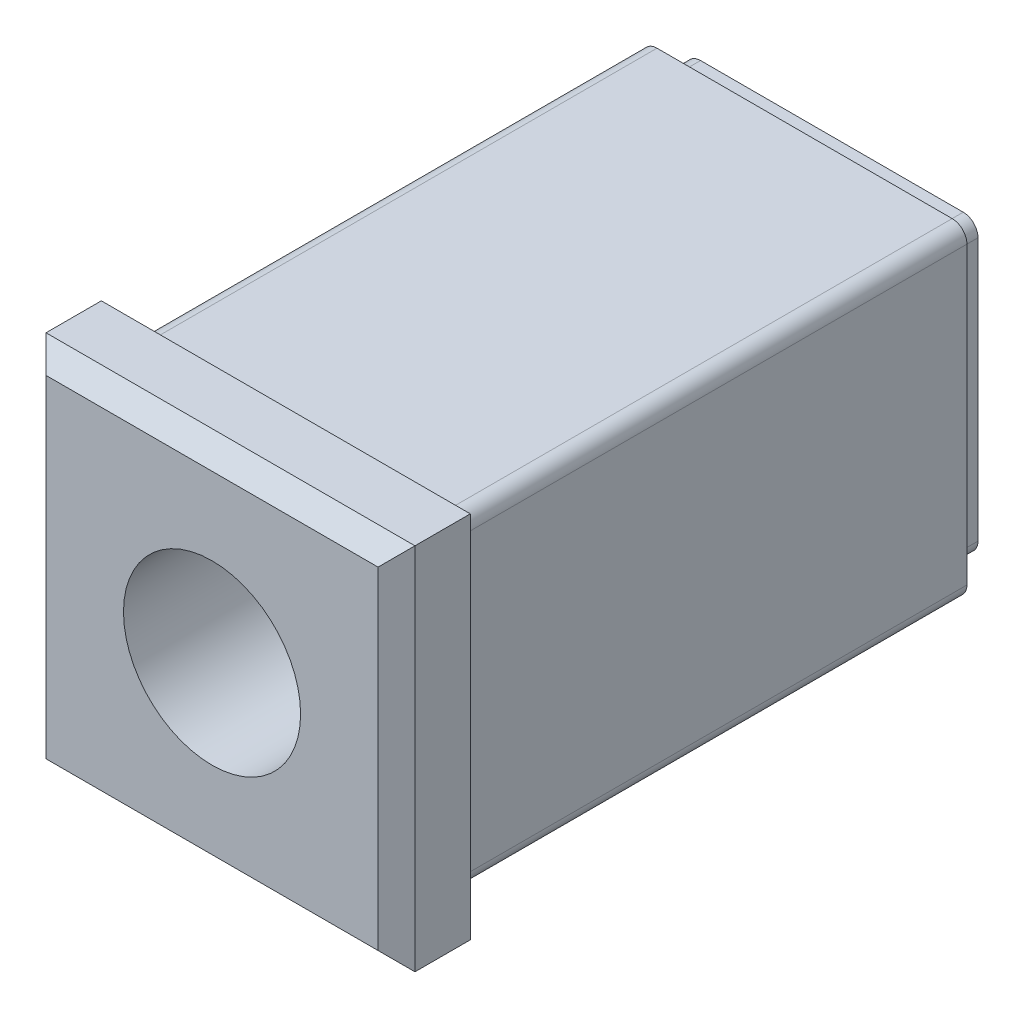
ISO-10303-21;
HEADER;
FILE_DESCRIPTION(('STEP AP214'),'2;1');
FILE_NAME('part.step','',(''),(''),'','','');
FILE_SCHEMA(('AUTOMOTIVE_DESIGN { 1 0 10303 214 1 1 1 1 }'));
ENDSEC;
DATA;
#1=APPLICATION_CONTEXT('core data for automotive mechanical design processes');
#2=APPLICATION_PROTOCOL_DEFINITION('international standard','automotive_design',2000,#1);
#3=PRODUCT_CONTEXT('',#1,'mechanical');
#4=PRODUCT('Part','Part','',(#3));
#5=PRODUCT_RELATED_PRODUCT_CATEGORY('part','',(#4));
#6=PRODUCT_DEFINITION_FORMATION('','',#4);
#7=PRODUCT_DEFINITION_CONTEXT('part definition',#1,'design');
#8=PRODUCT_DEFINITION('design','',#6,#7);
#9=PRODUCT_DEFINITION_SHAPE('','',#8);
#10=(LENGTH_UNIT() NAMED_UNIT(*) SI_UNIT(.MILLI.,.METRE.));
#11=(NAMED_UNIT(*) PLANE_ANGLE_UNIT() SI_UNIT($,.RADIAN.));
#12=(NAMED_UNIT(*) SI_UNIT($,.STERADIAN.) SOLID_ANGLE_UNIT());
#13=UNCERTAINTY_MEASURE_WITH_UNIT(LENGTH_MEASURE(1.E-05),#10,'distance_accuracy_value','');
#14=(GEOMETRIC_REPRESENTATION_CONTEXT(3) GLOBAL_UNCERTAINTY_ASSIGNED_CONTEXT((#13)) GLOBAL_UNIT_ASSIGNED_CONTEXT((#10,
#11,#12)) REPRESENTATION_CONTEXT('',''));
#15=CARTESIAN_POINT('',(0.,0.,0.));
#16=DIRECTION('',(0.,0.,1.));
#17=DIRECTION('',(1.,0.,0.));
#18=AXIS2_PLACEMENT_3D('',#15,#16,#17);
#19=CARTESIAN_POINT('',(-11.25,0.,5.));
#20=DIRECTION('',(0.,0.,1.));
#21=DIRECTION('',(0.,1.,0.));
#22=AXIS2_PLACEMENT_3D('',#19,#20,#21);
#23=PLANE('',#22);
#24=DIRECTION('',(0.,-1.,0.));
#25=VECTOR('',#24,1.);
#26=CARTESIAN_POINT('',(11.25,0.,5.));
#27=LINE('',#26,#25);
#28=CARTESIAN_POINT('',(11.25,11.25,5.));
#29=VERTEX_POINT('',#28);
#30=CARTESIAN_POINT('',(11.25,-11.25,5.));
#31=VERTEX_POINT('',#30);
#32=EDGE_CURVE('E237',#29,#31,#27,.T.);
#33=ORIENTED_EDGE('',*,*,#32,.F.);
#34=DIRECTION('',(-1.,0.,0.));
#35=VECTOR('',#34,1.);
#36=CARTESIAN_POINT('',(-25.,11.25,5.));
#37=LINE('',#36,#35);
#38=CARTESIAN_POINT('',(-11.25,11.25,5.));
#39=VERTEX_POINT('',#38);
#40=EDGE_CURVE('E188',#29,#39,#37,.T.);
#41=ORIENTED_EDGE('',*,*,#40,.T.);
#42=DIRECTION('',(0.,-1.,0.));
#43=VECTOR('',#42,1.);
#44=CARTESIAN_POINT('',(-11.25,0.,5.));
#45=LINE('',#44,#43);
#46=CARTESIAN_POINT('',(-11.25,-11.25,5.));
#47=VERTEX_POINT('',#46);
#48=EDGE_CURVE('E347',#47,#39,#45,.F.);
#49=ORIENTED_EDGE('',*,*,#48,.F.);
#50=DIRECTION('',(-1.,0.,0.));
#51=VECTOR('',#50,1.);
#52=CARTESIAN_POINT('',(37.,-11.25,5.));
#53=LINE('',#52,#51);
#54=EDGE_CURVE('E360',#47,#31,#53,.F.);
#55=ORIENTED_EDGE('',*,*,#54,.T.);
#56=EDGE_LOOP('',(#33,#41,#49,#55));
#57=FACE_BOUND('',#56,.T.);
#58=CARTESIAN_POINT('',(0.,0.,5.));
#59=DIRECTION('',(0.,0.,1.));
#60=DIRECTION('',(0.,1.,0.));
#61=AXIS2_PLACEMENT_3D('',#58,#59,#60);
#62=CIRCLE('',#61,6.);
#63=CARTESIAN_POINT('',(0.,6.,5.));
#64=VERTEX_POINT('',#63);
#65=EDGE_CURVE('E653',#64,#64,#62,.T.);
#66=ORIENTED_EDGE('',*,*,#65,.F.);
#67=EDGE_LOOP('',(#66));
#68=FACE_BOUND('',#67,.T.);
#69=ADVANCED_FACE('F14',(#57,#68),#23,.T.);
#70=CARTESIAN_POINT('',(37.,-12.5,3.75));
#71=DIRECTION('',(0.,0.707106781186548,-0.707106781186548));
#72=DIRECTION('',(0.,-0.707106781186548,-0.707106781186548));
#73=AXIS2_PLACEMENT_3D('',#70,#71,#72);
#74=PLANE('',#73);
#75=DIRECTION('',(1.,0.,0.));
#76=VECTOR('',#75,1.);
#77=CARTESIAN_POINT('',(0.,-12.5,3.75));
#78=LINE('',#77,#76);
#79=CARTESIAN_POINT('',(-12.5,-12.5,3.75));
#80=VERTEX_POINT('',#79);
#81=CARTESIAN_POINT('',(12.5,-12.5,3.75));
#82=VERTEX_POINT('',#81);
#83=EDGE_CURVE('E338',#80,#82,#78,.T.);
#84=ORIENTED_EDGE('',*,*,#83,.T.);
#85=DIRECTION('',(0.577350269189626,-0.577350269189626,-0.577350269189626));
#86=VECTOR('',#85,1.);
#87=CARTESIAN_POINT('',(11.25,-11.25,5.));
#88=LINE('',#87,#86);
#89=EDGE_CURVE('E363',#31,#82,#88,.T.);
#90=ORIENTED_EDGE('',*,*,#89,.F.);
#91=ORIENTED_EDGE('',*,*,#54,.F.);
#92=DIRECTION('',(0.577350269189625,0.577350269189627,0.577350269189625));
#93=VECTOR('',#92,1.);
#94=CARTESIAN_POINT('',(-12.5,-12.5,3.75));
#95=LINE('',#94,#93);
#96=EDGE_CURVE('E349',#80,#47,#95,.T.);
#97=ORIENTED_EDGE('',*,*,#96,.F.);
#98=EDGE_LOOP('',(#84,#90,#91,#97));
#99=FACE_BOUND('',#98,.T.);
#100=ADVANCED_FACE('F441',(#99),#74,.F.);
#101=CARTESIAN_POINT('',(11.25,0.,5.));
#102=DIRECTION('',(0.707106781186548,0.,0.707106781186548));
#103=DIRECTION('',(-0.707106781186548,0.,0.707106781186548));
#104=AXIS2_PLACEMENT_3D('',#101,#102,#103);
#105=PLANE('',#104);
#106=DIRECTION('',(0.,-1.,0.));
#107=VECTOR('',#106,1.);
#108=CARTESIAN_POINT('',(12.5,0.,3.75));
#109=LINE('',#108,#107);
#110=CARTESIAN_POINT('',(12.5,12.5,3.75));
#111=VERTEX_POINT('',#110);
#112=EDGE_CURVE('E18',#111,#82,#109,.T.);
#113=ORIENTED_EDGE('',*,*,#112,.F.);
#114=DIRECTION('',(-0.577350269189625,-0.577350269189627,0.577350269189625));
#115=VECTOR('',#114,1.);
#116=CARTESIAN_POINT('',(12.5,12.5,3.75));
#117=LINE('',#116,#115);
#118=EDGE_CURVE('E164',#111,#29,#117,.T.);
#119=ORIENTED_EDGE('',*,*,#118,.T.);
#120=ORIENTED_EDGE('',*,*,#32,.T.);
#121=ORIENTED_EDGE('',*,*,#89,.T.);
#122=EDGE_LOOP('',(#113,#119,#120,#121));
#123=FACE_BOUND('',#122,.T.);
#124=ADVANCED_FACE('F443',(#123),#105,.T.);
#125=CARTESIAN_POINT('',(-12.5,0.,3.75));
#126=DIRECTION('',(-0.707106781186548,0.,0.707106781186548));
#127=DIRECTION('',(-0.707106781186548,0.,-0.707106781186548));
#128=AXIS2_PLACEMENT_3D('',#125,#126,#127);
#129=PLANE('',#128);
#130=ORIENTED_EDGE('',*,*,#48,.T.);
#131=DIRECTION('',(-0.577350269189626,0.577350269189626,-0.577350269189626));
#132=VECTOR('',#131,1.);
#133=CARTESIAN_POINT('',(-11.25,11.25,5.));
#134=LINE('',#133,#132);
#135=CARTESIAN_POINT('',(-12.5,12.5,3.75));
#136=VERTEX_POINT('',#135);
#137=EDGE_CURVE('E187',#39,#136,#134,.T.);
#138=ORIENTED_EDGE('',*,*,#137,.T.);
#139=DIRECTION('',(0.,1.,0.));
#140=VECTOR('',#139,1.);
#141=CARTESIAN_POINT('',(-12.5,0.,3.75));
#142=LINE('',#141,#140);
#143=EDGE_CURVE('E333',#80,#136,#142,.T.);
#144=ORIENTED_EDGE('',*,*,#143,.F.);
#145=ORIENTED_EDGE('',*,*,#96,.T.);
#146=EDGE_LOOP('',(#130,#138,#144,#145));
#147=FACE_BOUND('',#146,.T.);
#148=ADVANCED_FACE('F446',(#147),#129,.T.);
#149=CARTESIAN_POINT('',(12.5,0.,-37.));
#150=DIRECTION('',(0.,0.,-1.));
#151=DIRECTION('',(0.,-1.,0.));
#152=AXIS2_PLACEMENT_3D('',#149,#150,#151);
#153=PLANE('',#152);
#154=DIRECTION('',(1.,0.,0.));
#155=VECTOR('',#154,1.);
#156=CARTESIAN_POINT('',(8.9,-9.9,-37.));
#157=LINE('',#156,#155);
#158=CARTESIAN_POINT('',(8.9,-9.9,-37.));
#159=VERTEX_POINT('',#158);
#160=CARTESIAN_POINT('',(-8.9,-9.9,-37.));
#161=VERTEX_POINT('',#160);
#162=EDGE_CURVE('E322',#159,#161,#157,.F.);
#163=ORIENTED_EDGE('',*,*,#162,.T.);
#164=CARTESIAN_POINT('',(-8.9,-8.9,-37.));
#165=DIRECTION('',(0.,0.,1.));
#166=DIRECTION('',(0.,1.,0.));
#167=AXIS2_PLACEMENT_3D('',#164,#165,#166);
#168=CIRCLE('',#167,1.);
#169=CARTESIAN_POINT('',(-9.9,-8.9,-37.));
#170=VERTEX_POINT('',#169);
#171=EDGE_CURVE('E375',#161,#170,#168,.F.);
#172=ORIENTED_EDGE('',*,*,#171,.T.);
#173=DIRECTION('',(0.,-1.,0.));
#174=VECTOR('',#173,1.);
#175=CARTESIAN_POINT('',(-9.9,-8.9,-37.));
#176=LINE('',#175,#174);
#177=CARTESIAN_POINT('',(-9.9,8.9,-37.));
#178=VERTEX_POINT('',#177);
#179=EDGE_CURVE('E327',#170,#178,#176,.F.);
#180=ORIENTED_EDGE('',*,*,#179,.T.);
#181=CARTESIAN_POINT('',(-8.9,8.9,-37.));
#182=DIRECTION('',(0.,0.,1.));
#183=DIRECTION('',(0.,1.,0.));
#184=AXIS2_PLACEMENT_3D('',#181,#182,#183);
#185=CIRCLE('',#184,1.);
#186=CARTESIAN_POINT('',(-8.9,9.9,-37.));
#187=VERTEX_POINT('',#186);
#188=EDGE_CURVE('E211',#178,#187,#185,.F.);
#189=ORIENTED_EDGE('',*,*,#188,.T.);
#190=DIRECTION('',(-1.,0.,0.));
#191=VECTOR('',#190,1.);
#192=CARTESIAN_POINT('',(-8.9,9.9,-37.));
#193=LINE('',#192,#191);
#194=CARTESIAN_POINT('',(8.9,9.9,-37.));
#195=VERTEX_POINT('',#194);
#196=EDGE_CURVE('E181',#187,#195,#193,.F.);
#197=ORIENTED_EDGE('',*,*,#196,.T.);
#198=CARTESIAN_POINT('',(8.9,8.9,-37.));
#199=DIRECTION('',(0.,0.,1.));
#200=DIRECTION('',(0.,1.,0.));
#201=AXIS2_PLACEMENT_3D('',#198,#199,#200);
#202=CIRCLE('',#201,1.);
#203=CARTESIAN_POINT('',(9.9,8.9,-37.));
#204=VERTEX_POINT('',#203);
#205=EDGE_CURVE('E193',#195,#204,#202,.F.);
#206=ORIENTED_EDGE('',*,*,#205,.T.);
#207=DIRECTION('',(0.,1.,0.));
#208=VECTOR('',#207,1.);
#209=CARTESIAN_POINT('',(9.9,8.9,-37.));
#210=LINE('',#209,#208);
#211=CARTESIAN_POINT('',(9.9,-8.9,-37.));
#212=VERTEX_POINT('',#211);
#213=EDGE_CURVE('E167',#204,#212,#210,.F.);
#214=ORIENTED_EDGE('',*,*,#213,.T.);
#215=CARTESIAN_POINT('',(8.9,-8.9,-37.));
#216=DIRECTION('',(0.,0.,1.));
#217=DIRECTION('',(0.,1.,0.));
#218=AXIS2_PLACEMENT_3D('',#215,#216,#217);
#219=CIRCLE('',#218,1.);
#220=EDGE_CURVE('E377',#212,#159,#219,.F.);
#221=ORIENTED_EDGE('',*,*,#220,.T.);
#222=EDGE_LOOP('',(#163,#172,#180,#189,#197,#206,#214,#221));
#223=FACE_BOUND('',#222,.T.);
#224=CARTESIAN_POINT('',(0.,0.,-37.));
#225=DIRECTION('',(0.,0.,-1.));
#226=DIRECTION('',(0.,-1.,0.));
#227=AXIS2_PLACEMENT_3D('',#224,#225,#226);
#228=CIRCLE('',#227,6.);
#229=CARTESIAN_POINT('',(0.,-6.,-37.));
#230=VERTEX_POINT('',#229);
#231=EDGE_CURVE('E191',#230,#230,#228,.T.);
#232=ORIENTED_EDGE('',*,*,#231,.F.);
#233=EDGE_LOOP('',(#232));
#234=FACE_BOUND('',#233,.T.);
#235=ADVANCED_FACE('F389',(#223,#234),#153,.T.);
#236=CARTESIAN_POINT('',(-12.5,0.,-37.));
#237=DIRECTION('',(-1.,0.,0.));
#238=DIRECTION('',(0.,1.,0.));
#239=AXIS2_PLACEMENT_3D('',#236,#237,#238);
#240=PLANE('',#239);
#241=ORIENTED_EDGE('',*,*,#143,.T.);
#242=DIRECTION('',(0.,0.,-1.));
#243=VECTOR('',#242,1.);
#244=CARTESIAN_POINT('',(-12.5,12.5,5.));
#245=LINE('',#244,#243);
#246=CARTESIAN_POINT('',(-12.5,12.5,0.));
#247=VERTEX_POINT('',#246);
#248=EDGE_CURVE('E174',#136,#247,#245,.T.);
#249=ORIENTED_EDGE('',*,*,#248,.T.);
#250=DIRECTION('',(0.,-1.,0.));
#251=VECTOR('',#250,1.);
#252=CARTESIAN_POINT('',(-12.5,0.,0.));
#253=LINE('',#252,#251);
#254=CARTESIAN_POINT('',(-12.5,-12.5,0.));
#255=VERTEX_POINT('',#254);
#256=EDGE_CURVE('E309',#255,#247,#253,.F.);
#257=ORIENTED_EDGE('',*,*,#256,.F.);
#258=DIRECTION('',(0.,0.,-1.));
#259=VECTOR('',#258,1.);
#260=CARTESIAN_POINT('',(-12.5,-12.5,-37.));
#261=LINE('',#260,#259);
#262=EDGE_CURVE('E337',#255,#80,#261,.F.);
#263=ORIENTED_EDGE('',*,*,#262,.T.);
#264=EDGE_LOOP('',(#241,#249,#257,#263));
#265=FACE_BOUND('',#264,.T.);
#266=ADVANCED_FACE('F467',(#265),#240,.T.);
#267=CARTESIAN_POINT('',(0.,-12.5,5.));
#268=DIRECTION('',(0.,1.,0.));
#269=DIRECTION('',(1.,0.,0.));
#270=AXIS2_PLACEMENT_3D('',#267,#268,#269);
#271=PLANE('',#270);
#272=DIRECTION('',(0.,0.,-1.));
#273=VECTOR('',#272,1.);
#274=CARTESIAN_POINT('',(12.5,-12.5,5.));
#275=LINE('',#274,#273);
#276=CARTESIAN_POINT('',(12.5,-12.5,0.));
#277=VERTEX_POINT('',#276);
#278=EDGE_CURVE('E334',#82,#277,#275,.T.);
#279=ORIENTED_EDGE('',*,*,#278,.F.);
#280=ORIENTED_EDGE('',*,*,#83,.F.);
#281=ORIENTED_EDGE('',*,*,#262,.F.);
#282=DIRECTION('',(-1.,0.,0.));
#283=VECTOR('',#282,1.);
#284=CARTESIAN_POINT('',(0.,-12.5,0.));
#285=LINE('',#284,#283);
#286=EDGE_CURVE('E312',#277,#255,#285,.T.);
#287=ORIENTED_EDGE('',*,*,#286,.F.);
#288=EDGE_LOOP('',(#279,#280,#281,#287));
#289=FACE_BOUND('',#288,.T.);
#290=ADVANCED_FACE('F470',(#289),#271,.F.);
#291=CARTESIAN_POINT('',(12.5,0.,3.75));
#292=DIRECTION('',(1.,0.,0.));
#293=DIRECTION('',(0.,-1.,0.));
#294=AXIS2_PLACEMENT_3D('',#291,#292,#293);
#295=PLANE('',#294);
#296=ORIENTED_EDGE('',*,*,#112,.T.);
#297=ORIENTED_EDGE('',*,*,#278,.T.);
#298=DIRECTION('',(0.,-1.,0.));
#299=VECTOR('',#298,1.);
#300=CARTESIAN_POINT('',(12.5,0.,0.));
#301=LINE('',#300,#299);
#302=CARTESIAN_POINT('',(12.5,12.5,0.));
#303=VERTEX_POINT('',#302);
#304=EDGE_CURVE('E315',#303,#277,#301,.T.);
#305=ORIENTED_EDGE('',*,*,#304,.F.);
#306=DIRECTION('',(0.,0.,-1.));
#307=VECTOR('',#306,1.);
#308=CARTESIAN_POINT('',(12.5,12.5,-37.));
#309=LINE('',#308,#307);
#310=EDGE_CURVE('E169',#303,#111,#309,.F.);
#311=ORIENTED_EDGE('',*,*,#310,.T.);
#312=EDGE_LOOP('',(#296,#297,#305,#311));
#313=FACE_BOUND('',#312,.T.);
#314=ADVANCED_FACE('F474',(#313),#295,.T.);
#315=CARTESIAN_POINT('',(10.,-11.,0.));
#316=DIRECTION('',(0.,1.,0.));
#317=DIRECTION('',(1.,0.,0.));
#318=AXIS2_PLACEMENT_3D('',#315,#316,#317);
#319=PLANE('',#318);
#320=DIRECTION('',(0.,0.,-1.));
#321=VECTOR('',#320,1.);
#322=CARTESIAN_POINT('',(10.,-11.,0.));
#323=LINE('',#322,#321);
#324=CARTESIAN_POINT('',(10.,-11.,0.));
#325=VERTEX_POINT('',#324);
#326=CARTESIAN_POINT('',(10.,-11.,-35.15));
#327=VERTEX_POINT('',#326);
#328=EDGE_CURVE('E24',#325,#327,#323,.T.);
#329=ORIENTED_EDGE('',*,*,#328,.F.);
#330=DIRECTION('',(1.,0.,0.));
#331=VECTOR('',#330,1.);
#332=CARTESIAN_POINT('',(10.,-11.,0.));
#333=LINE('',#332,#331);
#334=CARTESIAN_POINT('',(-10.,-11.,0.));
#335=VERTEX_POINT('',#334);
#336=EDGE_CURVE('E279',#335,#325,#333,.T.);
#337=ORIENTED_EDGE('',*,*,#336,.F.);
#338=DIRECTION('',(0.,0.,-1.));
#339=VECTOR('',#338,1.);
#340=CARTESIAN_POINT('',(-10.,-11.,0.));
#341=LINE('',#340,#339);
#342=CARTESIAN_POINT('',(-10.,-11.,-35.15));
#343=VERTEX_POINT('',#342);
#344=EDGE_CURVE('E276',#343,#335,#341,.F.);
#345=ORIENTED_EDGE('',*,*,#344,.F.);
#346=DIRECTION('',(1.,0.,0.));
#347=VECTOR('',#346,1.);
#348=CARTESIAN_POINT('',(10.,-11.,-35.15));
#349=LINE('',#348,#347);
#350=EDGE_CURVE('E9',#327,#343,#349,.F.);
#351=ORIENTED_EDGE('',*,*,#350,.F.);
#352=EDGE_LOOP('',(#329,#337,#345,#351));
#353=FACE_BOUND('',#352,.T.);
#354=ADVANCED_FACE('F477',(#353),#319,.F.);
#355=CARTESIAN_POINT('',(10.,-10.,0.));
#356=DIRECTION('',(0.,0.,1.));
#357=DIRECTION('',(0.,1.,0.));
#358=AXIS2_PLACEMENT_3D('',#355,#356,#357);
#359=CYLINDRICAL_SURFACE('',#358,1.);
#360=CARTESIAN_POINT('',(10.,-10.,0.));
#361=DIRECTION('',(0.,0.,1.));
#362=DIRECTION('',(0.,1.,0.));
#363=AXIS2_PLACEMENT_3D('',#360,#361,#362);
#364=CIRCLE('',#363,1.);
#365=CARTESIAN_POINT('',(11.,-10.,0.));
#366=VERTEX_POINT('',#365);
#367=EDGE_CURVE('E295',#366,#325,#364,.F.);
#368=ORIENTED_EDGE('',*,*,#367,.T.);
#369=ORIENTED_EDGE('',*,*,#328,.T.);
#370=CARTESIAN_POINT('',(10.,-10.,-35.15));
#371=DIRECTION('',(0.,0.,1.));
#372=DIRECTION('',(0.,1.,0.));
#373=AXIS2_PLACEMENT_3D('',#370,#371,#372);
#374=CIRCLE('',#373,1.);
#375=CARTESIAN_POINT('',(11.,-10.,-35.15));
#376=VERTEX_POINT('',#375);
#377=EDGE_CURVE('E32',#376,#327,#374,.F.);
#378=ORIENTED_EDGE('',*,*,#377,.F.);
#379=DIRECTION('',(0.,0.,1.));
#380=VECTOR('',#379,1.);
#381=CARTESIAN_POINT('',(11.,-10.,0.));
#382=LINE('',#381,#380);
#383=EDGE_CURVE('E304',#376,#366,#382,.T.);
#384=ORIENTED_EDGE('',*,*,#383,.T.);
#385=EDGE_LOOP('',(#368,#369,#378,#384));
#386=FACE_BOUND('',#385,.T.);
#387=ADVANCED_FACE('F512',(#386),#359,.T.);
#388=CARTESIAN_POINT('',(11.,10.,0.));
#389=DIRECTION('',(-1.,0.,0.));
#390=DIRECTION('',(0.,1.,0.));
#391=AXIS2_PLACEMENT_3D('',#388,#389,#390);
#392=PLANE('',#391);
#393=DIRECTION('',(0.,-1.,0.));
#394=VECTOR('',#393,1.);
#395=CARTESIAN_POINT('',(11.,0.,-35.15));
#396=LINE('',#395,#394);
#397=CARTESIAN_POINT('',(11.,10.,-35.15));
#398=VERTEX_POINT('',#397);
#399=EDGE_CURVE('E153',#398,#376,#396,.T.);
#400=ORIENTED_EDGE('',*,*,#399,.F.);
#401=DIRECTION('',(0.,0.,1.));
#402=VECTOR('',#401,1.);
#403=CARTESIAN_POINT('',(11.,10.,0.));
#404=LINE('',#403,#402);
#405=CARTESIAN_POINT('',(11.,10.,0.));
#406=VERTEX_POINT('',#405);
#407=EDGE_CURVE('E244',#406,#398,#404,.F.);
#408=ORIENTED_EDGE('',*,*,#407,.F.);
#409=DIRECTION('',(0.,-1.,0.));
#410=VECTOR('',#409,1.);
#411=CARTESIAN_POINT('',(11.,0.,0.));
#412=LINE('',#411,#410);
#413=EDGE_CURVE('E302',#366,#406,#412,.F.);
#414=ORIENTED_EDGE('',*,*,#413,.F.);
#415=ORIENTED_EDGE('',*,*,#383,.F.);
#416=EDGE_LOOP('',(#400,#408,#414,#415));
#417=FACE_BOUND('',#416,.T.);
#418=ADVANCED_FACE('F405',(#417),#392,.F.);
#419=CARTESIAN_POINT('',(9.9,8.9,-35.15));
#420=DIRECTION('',(-1.,0.,0.));
#421=DIRECTION('',(0.,1.,0.));
#422=AXIS2_PLACEMENT_3D('',#419,#420,#421);
#423=PLANE('',#422);
#424=ORIENTED_EDGE('',*,*,#213,.F.);
#425=DIRECTION('',(0.,0.,-1.));
#426=VECTOR('',#425,1.);
#427=CARTESIAN_POINT('',(9.9,8.9,-35.15));
#428=LINE('',#427,#426);
#429=CARTESIAN_POINT('',(9.9,8.9,-35.15));
#430=VERTEX_POINT('',#429);
#431=EDGE_CURVE('E160',#430,#204,#428,.T.);
#432=ORIENTED_EDGE('',*,*,#431,.F.);
#433=DIRECTION('',(0.,-1.,0.));
#434=VECTOR('',#433,1.);
#435=CARTESIAN_POINT('',(9.9,0.,-35.15));
#436=LINE('',#435,#434);
#437=CARTESIAN_POINT('',(9.9,-8.9,-35.15));
#438=VERTEX_POINT('',#437);
#439=EDGE_CURVE('E146',#438,#430,#436,.F.);
#440=ORIENTED_EDGE('',*,*,#439,.F.);
#441=DIRECTION('',(0.,0.,-1.));
#442=VECTOR('',#441,1.);
#443=CARTESIAN_POINT('',(9.9,-8.9,-35.15));
#444=LINE('',#443,#442);
#445=EDGE_CURVE('E320',#212,#438,#444,.F.);
#446=ORIENTED_EDGE('',*,*,#445,.F.);
#447=EDGE_LOOP('',(#424,#432,#440,#446));
#448=FACE_BOUND('',#447,.T.);
#449=ADVANCED_FACE('F165',(#448),#423,.F.);
#450=CARTESIAN_POINT('',(8.9,-8.9,-35.15));
#451=DIRECTION('',(0.,0.,1.));
#452=DIRECTION('',(0.,1.,0.));
#453=AXIS2_PLACEMENT_3D('',#450,#451,#452);
#454=CYLINDRICAL_SURFACE('',#453,1.);
#455=CARTESIAN_POINT('',(8.9,-8.9,-35.15));
#456=DIRECTION('',(0.,0.,1.));
#457=DIRECTION('',(0.,1.,0.));
#458=AXIS2_PLACEMENT_3D('',#455,#456,#457);
#459=CIRCLE('',#458,1.);
#460=CARTESIAN_POINT('',(8.9,-9.9,-35.15));
#461=VERTEX_POINT('',#460);
#462=EDGE_CURVE('E149',#438,#461,#459,.F.);
#463=ORIENTED_EDGE('',*,*,#462,.T.);
#464=DIRECTION('',(0.,0.,-1.));
#465=VECTOR('',#464,1.);
#466=CARTESIAN_POINT('',(8.9,-9.9,-35.15));
#467=LINE('',#466,#465);
#468=EDGE_CURVE('E326',#461,#159,#467,.T.);
#469=ORIENTED_EDGE('',*,*,#468,.T.);
#470=ORIENTED_EDGE('',*,*,#220,.F.);
#471=ORIENTED_EDGE('',*,*,#445,.T.);
#472=EDGE_LOOP('',(#463,#469,#470,#471));
#473=FACE_BOUND('',#472,.T.);
#474=ADVANCED_FACE('F395',(#473),#454,.T.);
#475=CARTESIAN_POINT('',(8.9,-9.9,-35.15));
#476=DIRECTION('',(0.,1.,0.));
#477=DIRECTION('',(1.,0.,0.));
#478=AXIS2_PLACEMENT_3D('',#475,#476,#477);
#479=PLANE('',#478);
#480=ORIENTED_EDGE('',*,*,#468,.F.);
#481=DIRECTION('',(-1.,0.,0.));
#482=VECTOR('',#481,1.);
#483=CARTESIAN_POINT('',(0.,-9.9,-35.15));
#484=LINE('',#483,#482);
#485=CARTESIAN_POINT('',(-8.9,-9.9,-35.15));
#486=VERTEX_POINT('',#485);
#487=EDGE_CURVE('E154',#486,#461,#484,.F.);
#488=ORIENTED_EDGE('',*,*,#487,.F.);
#489=DIRECTION('',(0.,0.,-1.));
#490=VECTOR('',#489,1.);
#491=CARTESIAN_POINT('',(-8.9,-9.9,-35.15));
#492=LINE('',#491,#490);
#493=EDGE_CURVE('E323',#161,#486,#492,.F.);
#494=ORIENTED_EDGE('',*,*,#493,.F.);
#495=ORIENTED_EDGE('',*,*,#162,.F.);
#496=EDGE_LOOP('',(#480,#488,#494,#495));
#497=FACE_BOUND('',#496,.T.);
#498=ADVANCED_FACE('F394',(#497),#479,.F.);
#499=CARTESIAN_POINT('',(-8.9,-8.9,-35.15));
#500=DIRECTION('',(0.,0.,1.));
#501=DIRECTION('',(0.,1.,0.));
#502=AXIS2_PLACEMENT_3D('',#499,#500,#501);
#503=CYLINDRICAL_SURFACE('',#502,1.);
#504=CARTESIAN_POINT('',(-8.9,-8.9,-35.15));
#505=DIRECTION('',(0.,0.,1.));
#506=DIRECTION('',(0.,1.,0.));
#507=AXIS2_PLACEMENT_3D('',#504,#505,#506);
#508=CIRCLE('',#507,1.);
#509=CARTESIAN_POINT('',(-9.9,-8.9,-35.15));
#510=VERTEX_POINT('',#509);
#511=EDGE_CURVE('E228',#486,#510,#508,.F.);
#512=ORIENTED_EDGE('',*,*,#511,.T.);
#513=DIRECTION('',(0.,0.,-1.));
#514=VECTOR('',#513,1.);
#515=CARTESIAN_POINT('',(-9.9,-8.9,-35.15));
#516=LINE('',#515,#514);
#517=EDGE_CURVE('E330',#510,#170,#516,.T.);
#518=ORIENTED_EDGE('',*,*,#517,.T.);
#519=ORIENTED_EDGE('',*,*,#171,.F.);
#520=ORIENTED_EDGE('',*,*,#493,.T.);
#521=EDGE_LOOP('',(#512,#518,#519,#520));
#522=FACE_BOUND('',#521,.T.);
#523=ADVANCED_FACE('F382',(#522),#503,.T.);
#524=CARTESIAN_POINT('',(-9.9,-8.9,-35.15));
#525=DIRECTION('',(1.,0.,0.));
#526=DIRECTION('',(0.,-1.,0.));
#527=AXIS2_PLACEMENT_3D('',#524,#525,#526);
#528=PLANE('',#527);
#529=ORIENTED_EDGE('',*,*,#517,.F.);
#530=DIRECTION('',(0.,-1.,0.));
#531=VECTOR('',#530,1.);
#532=CARTESIAN_POINT('',(-9.9,0.,-35.15));
#533=LINE('',#532,#531);
#534=CARTESIAN_POINT('',(-9.9,8.9,-35.15));
#535=VERTEX_POINT('',#534);
#536=EDGE_CURVE('E293',#535,#510,#533,.T.);
#537=ORIENTED_EDGE('',*,*,#536,.F.);
#538=DIRECTION('',(0.,0.,-1.));
#539=VECTOR('',#538,1.);
#540=CARTESIAN_POINT('',(-9.9,8.9,-35.15));
#541=LINE('',#540,#539);
#542=EDGE_CURVE('E184',#178,#535,#541,.F.);
#543=ORIENTED_EDGE('',*,*,#542,.F.);
#544=ORIENTED_EDGE('',*,*,#179,.F.);
#545=EDGE_LOOP('',(#529,#537,#543,#544));
#546=FACE_BOUND('',#545,.T.);
#547=ADVANCED_FACE('F387',(#546),#528,.F.);
#548=CARTESIAN_POINT('',(-11.,-10.,0.));
#549=DIRECTION('',(1.,0.,0.));
#550=DIRECTION('',(0.,-1.,0.));
#551=AXIS2_PLACEMENT_3D('',#548,#549,#550);
#552=PLANE('',#551);
#553=DIRECTION('',(0.,0.,1.));
#554=VECTOR('',#553,1.);
#555=CARTESIAN_POINT('',(-11.,-10.,0.));
#556=LINE('',#555,#554);
#557=CARTESIAN_POINT('',(-11.,-10.,0.));
#558=VERTEX_POINT('',#557);
#559=CARTESIAN_POINT('',(-11.,-10.,-35.15));
#560=VERTEX_POINT('',#559);
#561=EDGE_CURVE('E316',#558,#560,#556,.F.);
#562=ORIENTED_EDGE('',*,*,#561,.F.);
#563=DIRECTION('',(0.,-1.,0.));
#564=VECTOR('',#563,1.);
#565=CARTESIAN_POINT('',(-11.,0.,0.));
#566=LINE('',#565,#564);
#567=CARTESIAN_POINT('',(-11.,10.,0.));
#568=VERTEX_POINT('',#567);
#569=EDGE_CURVE('E260',#568,#558,#566,.T.);
#570=ORIENTED_EDGE('',*,*,#569,.F.);
#571=DIRECTION('',(0.,0.,1.));
#572=VECTOR('',#571,1.);
#573=CARTESIAN_POINT('',(-11.,10.,0.));
#574=LINE('',#573,#572);
#575=CARTESIAN_POINT('',(-11.,10.,-35.15));
#576=VERTEX_POINT('',#575);
#577=EDGE_CURVE('E206',#576,#568,#574,.T.);
#578=ORIENTED_EDGE('',*,*,#577,.F.);
#579=DIRECTION('',(0.,-1.,0.));
#580=VECTOR('',#579,1.);
#581=CARTESIAN_POINT('',(-11.,0.,-35.15));
#582=LINE('',#581,#580);
#583=EDGE_CURVE('E272',#560,#576,#582,.F.);
#584=ORIENTED_EDGE('',*,*,#583,.F.);
#585=EDGE_LOOP('',(#562,#570,#578,#584));
#586=FACE_BOUND('',#585,.T.);
#587=ADVANCED_FACE('F458',(#586),#552,.F.);
#588=CARTESIAN_POINT('',(-10.,-10.,0.));
#589=DIRECTION('',(0.,0.,1.));
#590=DIRECTION('',(0.,1.,0.));
#591=AXIS2_PLACEMENT_3D('',#588,#589,#590);
#592=CYLINDRICAL_SURFACE('',#591,1.);
#593=CARTESIAN_POINT('',(-10.,-10.,0.));
#594=DIRECTION('',(0.,0.,1.));
#595=DIRECTION('',(0.,1.,0.));
#596=AXIS2_PLACEMENT_3D('',#593,#594,#595);
#597=CIRCLE('',#596,1.);
#598=EDGE_CURVE('E305',#558,#335,#597,.T.);
#599=ORIENTED_EDGE('',*,*,#598,.F.);
#600=ORIENTED_EDGE('',*,*,#561,.T.);
#601=CARTESIAN_POINT('',(-10.,-10.,-35.15));
#602=DIRECTION('',(0.,0.,1.));
#603=DIRECTION('',(0.,1.,0.));
#604=AXIS2_PLACEMENT_3D('',#601,#602,#603);
#605=CIRCLE('',#604,1.);
#606=EDGE_CURVE('E275',#343,#560,#605,.F.);
#607=ORIENTED_EDGE('',*,*,#606,.F.);
#608=ORIENTED_EDGE('',*,*,#344,.T.);
#609=EDGE_LOOP('',(#599,#600,#607,#608));
#610=FACE_BOUND('',#609,.T.);
#611=ADVANCED_FACE('F464',(#610),#592,.T.);
#612=CARTESIAN_POINT('',(0.,0.,-35.15));
#613=DIRECTION('',(0.,0.,-1.));
#614=DIRECTION('',(0.,-1.,0.));
#615=AXIS2_PLACEMENT_3D('',#612,#613,#614);
#616=PLANE('',#615);
#617=ORIENTED_EDGE('',*,*,#439,.T.);
#618=CARTESIAN_POINT('',(8.9,8.9,-35.15));
#619=DIRECTION('',(0.,0.,1.));
#620=DIRECTION('',(0.,1.,0.));
#621=AXIS2_PLACEMENT_3D('',#618,#619,#620);
#622=CIRCLE('',#621,1.);
#623=CARTESIAN_POINT('',(8.9,9.9,-35.15));
#624=VERTEX_POINT('',#623);
#625=EDGE_CURVE('E143',#624,#430,#622,.F.);
#626=ORIENTED_EDGE('',*,*,#625,.F.);
#627=DIRECTION('',(-1.,0.,0.));
#628=VECTOR('',#627,1.);
#629=CARTESIAN_POINT('',(0.,9.9,-35.15));
#630=LINE('',#629,#628);
#631=CARTESIAN_POINT('',(-8.9,9.9,-35.15));
#632=VERTEX_POINT('',#631);
#633=EDGE_CURVE('E203',#624,#632,#630,.T.);
#634=ORIENTED_EDGE('',*,*,#633,.T.);
#635=CARTESIAN_POINT('',(-8.9,8.9,-35.15));
#636=DIRECTION('',(0.,0.,1.));
#637=DIRECTION('',(0.,1.,0.));
#638=AXIS2_PLACEMENT_3D('',#635,#636,#637);
#639=CIRCLE('',#638,1.);
#640=EDGE_CURVE('E163',#535,#632,#639,.F.);
#641=ORIENTED_EDGE('',*,*,#640,.F.);
#642=ORIENTED_EDGE('',*,*,#536,.T.);
#643=ORIENTED_EDGE('',*,*,#511,.F.);
#644=ORIENTED_EDGE('',*,*,#487,.T.);
#645=ORIENTED_EDGE('',*,*,#462,.F.);
#646=EDGE_LOOP('',(#617,#626,#634,#641,#642,#643,#644,#645));
#647=FACE_BOUND('',#646,.T.);
#648=ORIENTED_EDGE('',*,*,#606,.T.);
#649=ORIENTED_EDGE('',*,*,#583,.T.);
#650=CARTESIAN_POINT('',(-10.,10.,-35.15));
#651=DIRECTION('',(0.,0.,1.));
#652=DIRECTION('',(0.,1.,0.));
#653=AXIS2_PLACEMENT_3D('',#650,#651,#652);
#654=CIRCLE('',#653,1.);
#655=CARTESIAN_POINT('',(-10.,11.,-35.15));
#656=VERTEX_POINT('',#655);
#657=EDGE_CURVE('E201',#576,#656,#654,.F.);
#658=ORIENTED_EDGE('',*,*,#657,.T.);
#659=DIRECTION('',(-1.,0.,0.));
#660=VECTOR('',#659,1.);
#661=CARTESIAN_POINT('',(-10.,11.,-35.15));
#662=LINE('',#661,#660);
#663=CARTESIAN_POINT('',(10.,11.,-35.15));
#664=VERTEX_POINT('',#663);
#665=EDGE_CURVE('E233',#656,#664,#662,.F.);
#666=ORIENTED_EDGE('',*,*,#665,.T.);
#667=CARTESIAN_POINT('',(10.,10.,-35.15));
#668=DIRECTION('',(0.,0.,1.));
#669=DIRECTION('',(0.,1.,0.));
#670=AXIS2_PLACEMENT_3D('',#667,#668,#669);
#671=CIRCLE('',#670,1.);
#672=EDGE_CURVE('E197',#664,#398,#671,.F.);
#673=ORIENTED_EDGE('',*,*,#672,.T.);
#674=ORIENTED_EDGE('',*,*,#399,.T.);
#675=ORIENTED_EDGE('',*,*,#377,.T.);
#676=ORIENTED_EDGE('',*,*,#350,.T.);
#677=EDGE_LOOP('',(#648,#649,#658,#666,#673,#674,#675,#676));
#678=FACE_BOUND('',#677,.T.);
#679=ADVANCED_FACE('F147',(#647,#678),#616,.T.);
#680=CARTESIAN_POINT('',(0.,0.,0.));
#681=DIRECTION('',(0.,0.,-1.));
#682=DIRECTION('',(0.,-1.,0.));
#683=AXIS2_PLACEMENT_3D('',#680,#681,#682);
#684=PLANE('',#683);
#685=ORIENTED_EDGE('',*,*,#413,.T.);
#686=CARTESIAN_POINT('',(10.,10.,0.));
#687=DIRECTION('',(0.,0.,1.));
#688=DIRECTION('',(0.,1.,0.));
#689=AXIS2_PLACEMENT_3D('',#686,#687,#688);
#690=CIRCLE('',#689,1.);
#691=CARTESIAN_POINT('',(10.,11.,0.));
#692=VERTEX_POINT('',#691);
#693=EDGE_CURVE('E207',#406,#692,#690,.T.);
#694=ORIENTED_EDGE('',*,*,#693,.T.);
#695=DIRECTION('',(-1.,0.,0.));
#696=VECTOR('',#695,1.);
#697=CARTESIAN_POINT('',(-10.,11.,0.));
#698=LINE('',#697,#696);
#699=CARTESIAN_POINT('',(-10.,11.,0.));
#700=VERTEX_POINT('',#699);
#701=EDGE_CURVE('E234',#692,#700,#698,.T.);
#702=ORIENTED_EDGE('',*,*,#701,.T.);
#703=CARTESIAN_POINT('',(-10.,10.,0.));
#704=DIRECTION('',(0.,0.,1.));
#705=DIRECTION('',(0.,1.,0.));
#706=AXIS2_PLACEMENT_3D('',#703,#704,#705);
#707=CIRCLE('',#706,1.);
#708=EDGE_CURVE('E204',#568,#700,#707,.F.);
#709=ORIENTED_EDGE('',*,*,#708,.F.);
#710=ORIENTED_EDGE('',*,*,#569,.T.);
#711=ORIENTED_EDGE('',*,*,#598,.T.);
#712=ORIENTED_EDGE('',*,*,#336,.T.);
#713=ORIENTED_EDGE('',*,*,#367,.F.);
#714=EDGE_LOOP('',(#685,#694,#702,#709,#710,#711,#712,#713));
#715=FACE_BOUND('',#714,.T.);
#716=DIRECTION('',(-1.,0.,0.));
#717=VECTOR('',#716,1.);
#718=CARTESIAN_POINT('',(0.,12.5,0.));
#719=LINE('',#718,#717);
#720=EDGE_CURVE('E209',#247,#303,#719,.F.);
#721=ORIENTED_EDGE('',*,*,#720,.T.);
#722=ORIENTED_EDGE('',*,*,#304,.T.);
#723=ORIENTED_EDGE('',*,*,#286,.T.);
#724=ORIENTED_EDGE('',*,*,#256,.T.);
#725=EDGE_LOOP('',(#721,#722,#723,#724));
#726=FACE_BOUND('',#725,.T.);
#727=ADVANCED_FACE('F258',(#715,#726),#684,.T.);
#728=CARTESIAN_POINT('',(-25.,12.5,3.75));
#729=DIRECTION('',(0.,-0.707106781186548,-0.707106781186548));
#730=DIRECTION('',(0.,-0.707106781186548,0.707106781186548));
#731=AXIS2_PLACEMENT_3D('',#728,#729,#730);
#732=PLANE('',#731);
#733=DIRECTION('',(-1.,0.,0.));
#734=VECTOR('',#733,1.);
#735=CARTESIAN_POINT('',(0.,12.5,3.75));
#736=LINE('',#735,#734);
#737=EDGE_CURVE('E180',#111,#136,#736,.T.);
#738=ORIENTED_EDGE('',*,*,#737,.T.);
#739=ORIENTED_EDGE('',*,*,#137,.F.);
#740=ORIENTED_EDGE('',*,*,#40,.F.);
#741=ORIENTED_EDGE('',*,*,#118,.F.);
#742=EDGE_LOOP('',(#738,#739,#740,#741));
#743=FACE_BOUND('',#742,.T.);
#744=ADVANCED_FACE('F16',(#743),#732,.F.);
#745=CARTESIAN_POINT('',(0.,12.5,5.));
#746=DIRECTION('',(0.,-1.,0.));
#747=DIRECTION('',(-1.,0.,0.));
#748=AXIS2_PLACEMENT_3D('',#745,#746,#747);
#749=PLANE('',#748);
#750=ORIENTED_EDGE('',*,*,#248,.F.);
#751=ORIENTED_EDGE('',*,*,#737,.F.);
#752=ORIENTED_EDGE('',*,*,#310,.F.);
#753=ORIENTED_EDGE('',*,*,#720,.F.);
#754=EDGE_LOOP('',(#750,#751,#752,#753));
#755=FACE_BOUND('',#754,.T.);
#756=ADVANCED_FACE('F410',(#755),#749,.F.);
#757=CARTESIAN_POINT('',(-10.,11.,0.));
#758=DIRECTION('',(0.,-1.,0.));
#759=DIRECTION('',(-1.,0.,0.));
#760=AXIS2_PLACEMENT_3D('',#757,#758,#759);
#761=PLANE('',#760);
#762=DIRECTION('',(0.,0.,-1.));
#763=VECTOR('',#762,1.);
#764=CARTESIAN_POINT('',(-10.,11.,0.));
#765=LINE('',#764,#763);
#766=EDGE_CURVE('E230',#700,#656,#765,.T.);
#767=ORIENTED_EDGE('',*,*,#766,.F.);
#768=ORIENTED_EDGE('',*,*,#701,.F.);
#769=DIRECTION('',(0.,0.,-1.));
#770=VECTOR('',#769,1.);
#771=CARTESIAN_POINT('',(10.,11.,0.));
#772=LINE('',#771,#770);
#773=EDGE_CURVE('E200',#664,#692,#772,.F.);
#774=ORIENTED_EDGE('',*,*,#773,.F.);
#775=ORIENTED_EDGE('',*,*,#665,.F.);
#776=EDGE_LOOP('',(#767,#768,#774,#775));
#777=FACE_BOUND('',#776,.T.);
#778=ADVANCED_FACE('F265',(#777),#761,.F.);
#779=CARTESIAN_POINT('',(-10.,10.,0.));
#780=DIRECTION('',(0.,0.,1.));
#781=DIRECTION('',(0.,1.,0.));
#782=AXIS2_PLACEMENT_3D('',#779,#780,#781);
#783=CYLINDRICAL_SURFACE('',#782,1.);
#784=ORIENTED_EDGE('',*,*,#708,.T.);
#785=ORIENTED_EDGE('',*,*,#766,.T.);
#786=ORIENTED_EDGE('',*,*,#657,.F.);
#787=ORIENTED_EDGE('',*,*,#577,.T.);
#788=EDGE_LOOP('',(#784,#785,#786,#787));
#789=FACE_BOUND('',#788,.T.);
#790=ADVANCED_FACE('F253',(#789),#783,.T.);
#791=CARTESIAN_POINT('',(-8.9,8.9,-35.15));
#792=DIRECTION('',(0.,0.,1.));
#793=DIRECTION('',(0.,1.,0.));
#794=AXIS2_PLACEMENT_3D('',#791,#792,#793);
#795=CYLINDRICAL_SURFACE('',#794,1.);
#796=ORIENTED_EDGE('',*,*,#640,.T.);
#797=DIRECTION('',(0.,0.,-1.));
#798=VECTOR('',#797,1.);
#799=CARTESIAN_POINT('',(-8.9,9.9,-35.15));
#800=LINE('',#799,#798);
#801=EDGE_CURVE('E171',#632,#187,#800,.T.);
#802=ORIENTED_EDGE('',*,*,#801,.T.);
#803=ORIENTED_EDGE('',*,*,#188,.F.);
#804=ORIENTED_EDGE('',*,*,#542,.T.);
#805=EDGE_LOOP('',(#796,#802,#803,#804));
#806=FACE_BOUND('',#805,.T.);
#807=ADVANCED_FACE('F218',(#806),#795,.T.);
#808=CARTESIAN_POINT('',(-8.9,9.9,-35.15));
#809=DIRECTION('',(0.,-1.,0.));
#810=DIRECTION('',(-1.,0.,0.));
#811=AXIS2_PLACEMENT_3D('',#808,#809,#810);
#812=PLANE('',#811);
#813=ORIENTED_EDGE('',*,*,#801,.F.);
#814=ORIENTED_EDGE('',*,*,#633,.F.);
#815=DIRECTION('',(0.,0.,-1.));
#816=VECTOR('',#815,1.);
#817=CARTESIAN_POINT('',(8.9,9.9,-35.15));
#818=LINE('',#817,#816);
#819=EDGE_CURVE('E161',#195,#624,#818,.F.);
#820=ORIENTED_EDGE('',*,*,#819,.F.);
#821=ORIENTED_EDGE('',*,*,#196,.F.);
#822=EDGE_LOOP('',(#813,#814,#820,#821));
#823=FACE_BOUND('',#822,.T.);
#824=ADVANCED_FACE('F224',(#823),#812,.F.);
#825=CARTESIAN_POINT('',(8.9,8.9,-35.15));
#826=DIRECTION('',(0.,0.,1.));
#827=DIRECTION('',(0.,1.,0.));
#828=AXIS2_PLACEMENT_3D('',#825,#826,#827);
#829=CYLINDRICAL_SURFACE('',#828,1.);
#830=ORIENTED_EDGE('',*,*,#625,.T.);
#831=ORIENTED_EDGE('',*,*,#431,.T.);
#832=ORIENTED_EDGE('',*,*,#205,.F.);
#833=ORIENTED_EDGE('',*,*,#819,.T.);
#834=EDGE_LOOP('',(#830,#831,#832,#833));
#835=FACE_BOUND('',#834,.T.);
#836=ADVANCED_FACE('F158',(#835),#829,.T.);
#837=CARTESIAN_POINT('',(10.,10.,0.));
#838=DIRECTION('',(0.,0.,1.));
#839=DIRECTION('',(0.,1.,0.));
#840=AXIS2_PLACEMENT_3D('',#837,#838,#839);
#841=CYLINDRICAL_SURFACE('',#840,1.);
#842=ORIENTED_EDGE('',*,*,#693,.F.);
#843=ORIENTED_EDGE('',*,*,#407,.T.);
#844=ORIENTED_EDGE('',*,*,#672,.F.);
#845=ORIENTED_EDGE('',*,*,#773,.T.);
#846=EDGE_LOOP('',(#842,#843,#844,#845));
#847=FACE_BOUND('',#846,.T.);
#848=ADVANCED_FACE('F269',(#847),#841,.T.);
#849=CARTESIAN_POINT('',(0.,0.,-66.2626983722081));
#850=DIRECTION('',(0.,0.,1.));
#851=DIRECTION('',(0.,1.,0.));
#852=AXIS2_PLACEMENT_3D('',#849,#850,#851);
#853=CYLINDRICAL_SURFACE('',#852,6.);
#854=ORIENTED_EDGE('',*,*,#231,.T.);
#855=EDGE_LOOP('',(#854));
#856=FACE_BOUND('',#855,.T.);
#857=ORIENTED_EDGE('',*,*,#65,.T.);
#858=EDGE_LOOP('',(#857));
#859=FACE_BOUND('',#858,.T.);
#860=ADVANCED_FACE('F420',(#856,#859),#853,.F.);
#861=CLOSED_SHELL('',(#69,#100,#124,#148,#235,#266,#290,#314,#354,#387,#418,#449,#474,#498,#523,
#547,#587,#611,#679,#727,#744,#756,#778,#790,#807,#824,#836,#848,#860));
#862=MANIFOLD_SOLID_BREP('B1',#861);
#863=ADVANCED_BREP_SHAPE_REPRESENTATION('',(#18,#862),#14);
#864=SHAPE_DEFINITION_REPRESENTATION(#9,#863);
ENDSEC;
END-ISO-10303-21;
